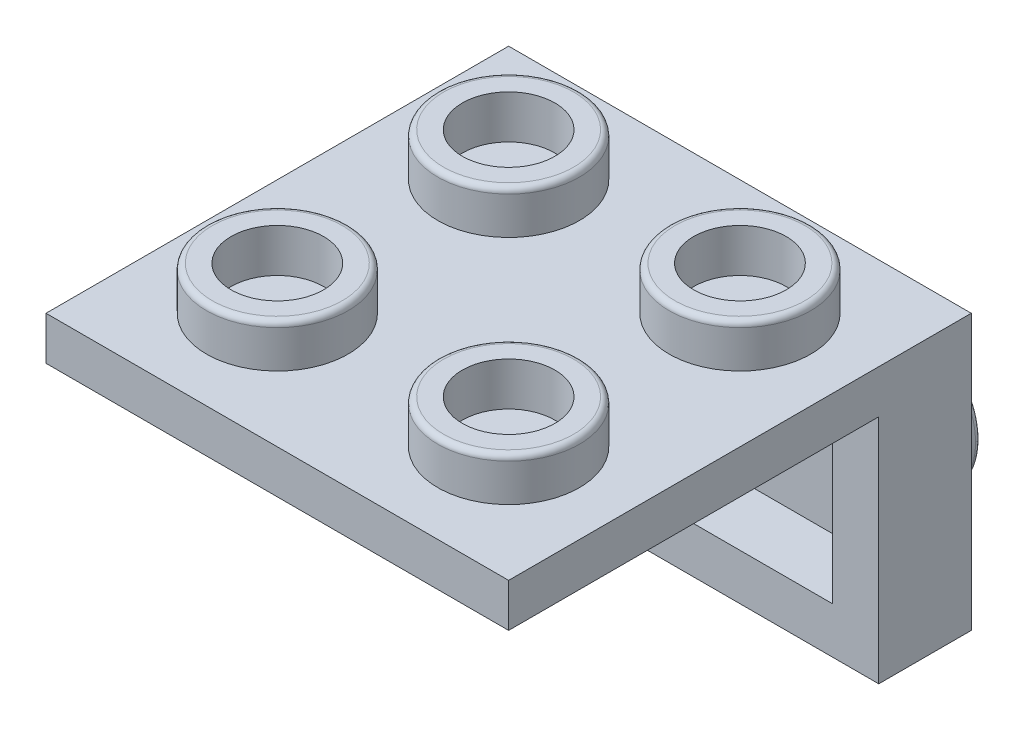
from build123d import *

# Parameters (mm, degrees)
SKIZZE1_W                         = 16
SKIZZE1_H                         = 8
LINEAR_AUSTRAGEN1_DEPTH           = 3.2
SKIZZE2_W                         = 12.8
SKIZZE2_H                         = 4.8
SCHNITT_LINEAR_AUSTRAGEN1_DEPTH   = 2.1
SKIZZE4_R                         = 2.45
LINEAR_AUSTRAGEN3_DEPTH           = 1.9
VERRUNDUNG1_R                     = 0.2
LINEARES_MUSTER1_COUNT            = 2
LINEARES_MUSTER1_PITCH            = 8
VERRUNDUNG1_OF_LINEARES_MUSTER1_R = 0.2
SKIZZE5_R                         = 1.5
SKIZZE5_R_2                       = 0.7
LINEAR_AUSTRAGEN4_DEPTH           = 2
SKIZZE6_W                         = 16
SKIZZE6_H                         = 16
LINEAR_AUSTRAGEN5_DEPTH           = 1.5
SKIZZE7_R                         = 2.45
SKIZZE7_R_2                       = 1.6
LINEAR_AUSTRAGEN6_DEPTH           = 1.5
VERRUNDUNG4_R                     = 0.2
LINEARES_MUSTER3_COUNT            = 2
LINEARES_MUSTER3_PITCH            = 8
LINEARES_MUSTER3_COUNT_DIR2       = 2
LINEARES_MUSTER3_PITCH_DIR2       = 8
VERRUNDUNG4_OF_LINEARES_MUSTER3_R = 0.2


with BuildPart() as part:
    # Skizze1 → Linear austragen1 (new body)
    with BuildSketch(Plane.XY):
        with Locations((-8, -4)):
            Rectangle(SKIZZE1_W, SKIZZE1_H)
    extrude(amount=LINEAR_AUSTRAGEN1_DEPTH)

    # Skizze2 → Schnitt-Linear austragen1 (cut)
    with BuildSketch(Plane.XY.offset(3.2)):
        with Locations((-8, -4)):
            Rectangle(SKIZZE2_W, SKIZZE2_H)
    extrude(amount=-SCHNITT_LINEAR_AUSTRAGEN1_DEPTH, mode=Mode.SUBTRACT)

    # Skizze4 → Linear austragen3 (add)
    with BuildSketch(Plane(origin=(0, 0, 0), x_dir=(-1, 0, 0), z_dir=(0, 0, -1))):
        with Locations(Location((4, -4, 0), (0, 0, 180))):
            Circle(SKIZZE4_R)
    linear_austragen3 = extrude(amount=LINEAR_AUSTRAGEN3_DEPTH)

    # Verrundung1
    verrundung1_edges = [part.edges().sort_by_distance(p)[0] for p in [
        (-6.45, -4, -1.9),
    ]]
    fillet(verrundung1_edges, radius=VERRUNDUNG1_R)

    # Lineares Muster1: Linear austragen3 ×2
    with Locations(*[(-i * LINEARES_MUSTER1_PITCH, 0, 0) for i in range(1, LINEARES_MUSTER1_COUNT)]):
        add(linear_austragen3)

    # Verrundung1 of Lineares Muster1
    verrundung1_of_lineares_muster1_edges = [part.edges().sort_by_distance(p)[0] for p in [
        (-14.45, -4, -1.9),
    ]]
    fillet(verrundung1_of_lineares_muster1_edges, radius=VERRUNDUNG1_OF_LINEARES_MUSTER1_R)

    # Skizze5 → Linear austragen4 (add)
    with BuildSketch(Plane.XY.offset(1.1)):
        with Locations((-7.912828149, -3.827526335)):
            Circle(SKIZZE5_R)
        with Locations((-7.912828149, -3.827526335)):
            Circle(SKIZZE5_R_2, mode=Mode.SUBTRACT)
    extrude(amount=LINEAR_AUSTRAGEN4_DEPTH)

    # Skizze6 → Linear austragen5 (add)
    with BuildSketch(Plane(origin=(0, 0, 0), x_dir=(-1, 0, 0), z_dir=(0, 1, 0))):
        with Locations((8, 8)):
            Rectangle(SKIZZE6_W, SKIZZE6_H)
    extrude(amount=LINEAR_AUSTRAGEN5_DEPTH)

    # Skizze7 → Linear austragen6 (add)
    with BuildSketch(Plane(origin=(0, 1.5, 0), x_dir=(-1, 0, 0), z_dir=(0, 1, 0))):
        with Locations((12, 4)):
            Circle(SKIZZE7_R)
        with Locations((12, 4)):
            Circle(SKIZZE7_R_2, mode=Mode.SUBTRACT)
    linear_austragen6 = extrude(amount=LINEAR_AUSTRAGEN6_DEPTH)

    # Verrundung4
    verrundung4_edges = [part.edges().sort_by_distance(p)[0] for p in [
        (-9.55, 3, 4),
    ]]
    fillet(verrundung4_edges, radius=VERRUNDUNG4_R)

    # Lineares Muster3: Linear austragen6 2 × 2
    with Locations(*[(i * LINEARES_MUSTER3_PITCH, 0, j * LINEARES_MUSTER3_PITCH_DIR2) for i in range(LINEARES_MUSTER3_COUNT) for j in range(LINEARES_MUSTER3_COUNT_DIR2) if (i, j) != (0, 0)]):
        add(linear_austragen6)

    # Verrundung4 of Lineares Muster3
    verrundung4_of_lineares_muster3_edges = [part.edges().sort_by_distance(p)[0] for p in [
        (-9.55, 3, 12),
        (-1.55, 3, 4),
        (-1.55, 3, 12),
    ]]
    fillet(verrundung4_of_lineares_muster3_edges, radius=VERRUNDUNG4_OF_LINEARES_MUSTER3_R)


solid = part.part
